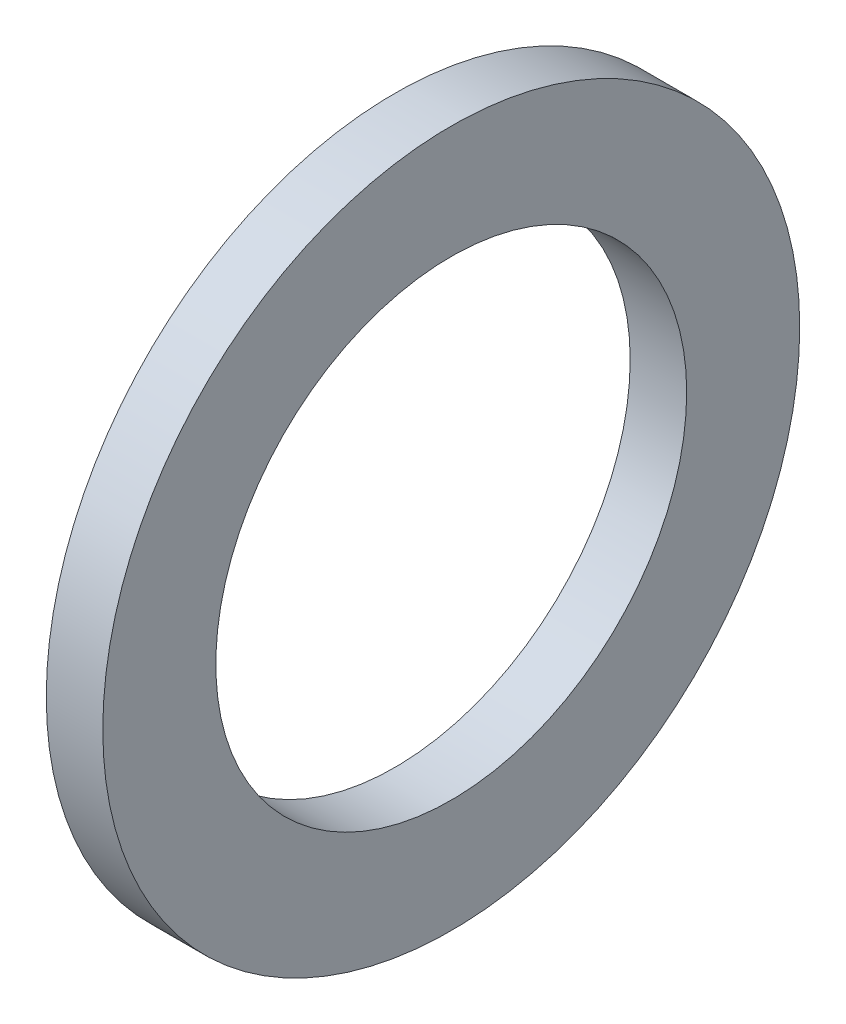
from build123d import *

# Parameters (mm, degrees)
ESQUISSE1_R          = 18.5
ESQUISSE1_R_2        = 12.5
BASE_EXTRUSION_DEPTH = 3


with BuildPart() as part:
    # Esquisse1 → Base-Extrusion (new body)
    with BuildSketch(Plane(origin=(0, 0, 0), x_dir=(0, 0, -1), z_dir=(1, 0, 0))):
        Circle(ESQUISSE1_R)
        Circle(ESQUISSE1_R_2, mode=Mode.SUBTRACT)
    extrude(amount=BASE_EXTRUSION_DEPTH)


solid = part.part
